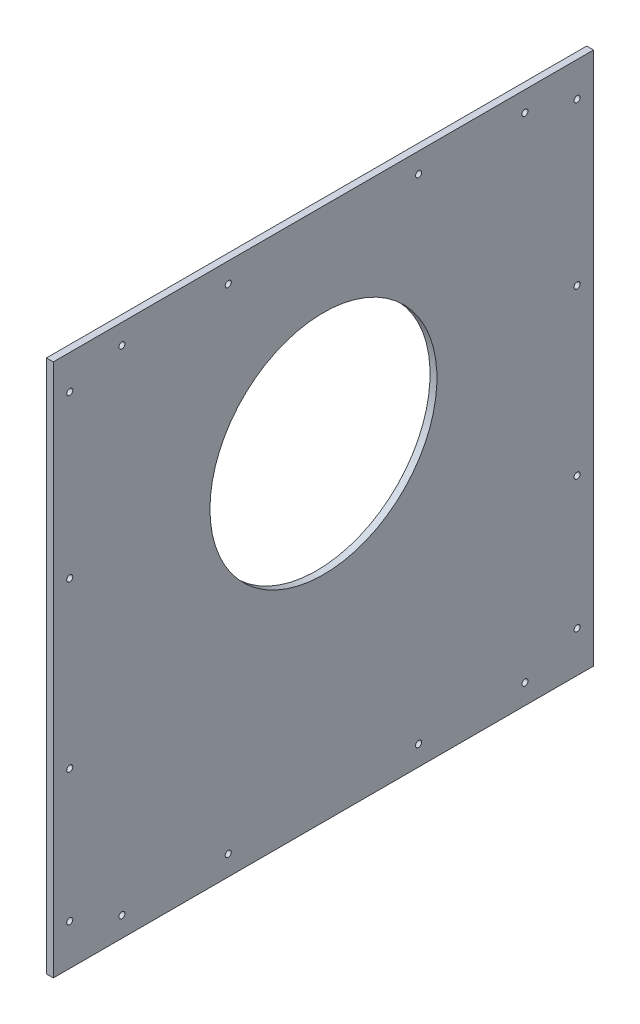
ISO-10303-21;
HEADER;
FILE_DESCRIPTION(('STEP AP214'),'2;1');
FILE_NAME('part.step','',(''),(''),'','','');
FILE_SCHEMA(('AUTOMOTIVE_DESIGN { 1 0 10303 214 1 1 1 1 }'));
ENDSEC;
DATA;
#1=APPLICATION_CONTEXT('core data for automotive mechanical design processes');
#2=APPLICATION_PROTOCOL_DEFINITION('international standard','automotive_design',2000,#1);
#3=PRODUCT_CONTEXT('',#1,'mechanical');
#4=PRODUCT('Part','Part','',(#3));
#5=PRODUCT_RELATED_PRODUCT_CATEGORY('part','',(#4));
#6=PRODUCT_DEFINITION_FORMATION('','',#4);
#7=PRODUCT_DEFINITION_CONTEXT('part definition',#1,'design');
#8=PRODUCT_DEFINITION('design','',#6,#7);
#9=PRODUCT_DEFINITION_SHAPE('','',#8);
#10=(LENGTH_UNIT() NAMED_UNIT(*) SI_UNIT(.MILLI.,.METRE.));
#11=(NAMED_UNIT(*) PLANE_ANGLE_UNIT() SI_UNIT($,.RADIAN.));
#12=(NAMED_UNIT(*) SI_UNIT($,.STERADIAN.) SOLID_ANGLE_UNIT());
#13=UNCERTAINTY_MEASURE_WITH_UNIT(LENGTH_MEASURE(1.E-05),#10,'distance_accuracy_value','');
#14=(GEOMETRIC_REPRESENTATION_CONTEXT(3) GLOBAL_UNCERTAINTY_ASSIGNED_CONTEXT((#13)) GLOBAL_UNIT_ASSIGNED_CONTEXT((#10,
#11,#12)) REPRESENTATION_CONTEXT('',''));
#15=CARTESIAN_POINT('',(0.,0.,0.));
#16=DIRECTION('',(0.,0.,1.));
#17=DIRECTION('',(1.,0.,0.));
#18=AXIS2_PLACEMENT_3D('',#15,#16,#17);
#19=CARTESIAN_POINT('',(6.35,0.,0.));
#20=DIRECTION('',(0.,0.,-1.));
#21=DIRECTION('',(-1.,0.,0.));
#22=AXIS2_PLACEMENT_3D('',#19,#20,#21);
#23=PLANE('',#22);
#24=DIRECTION('',(0.,-1.,0.));
#25=VECTOR('',#24,1.);
#26=CARTESIAN_POINT('',(0.,0.,0.));
#27=LINE('',#26,#25);
#28=CARTESIAN_POINT('',(0.,544.576,0.));
#29=VERTEX_POINT('',#28);
#30=CARTESIAN_POINT('',(0.,50.8,0.));
#31=VERTEX_POINT('',#30);
#32=EDGE_CURVE('E81',#29,#31,#27,.T.);
#33=ORIENTED_EDGE('',*,*,#32,.T.);
#34=DIRECTION('',(-1.,0.,0.));
#35=VECTOR('',#34,1.);
#36=CARTESIAN_POINT('',(6.35,50.8,0.));
#37=LINE('',#36,#35);
#38=CARTESIAN_POINT('',(6.35,50.8,0.));
#39=VERTEX_POINT('',#38);
#40=EDGE_CURVE('E47',#39,#31,#37,.T.);
#41=ORIENTED_EDGE('',*,*,#40,.F.);
#42=DIRECTION('',(0.,-1.,0.));
#43=VECTOR('',#42,1.);
#44=CARTESIAN_POINT('',(6.35,0.,0.));
#45=LINE('',#44,#43);
#46=CARTESIAN_POINT('',(6.35,544.576,0.));
#47=VERTEX_POINT('',#46);
#48=EDGE_CURVE('E76',#47,#39,#45,.T.);
#49=ORIENTED_EDGE('',*,*,#48,.F.);
#50=DIRECTION('',(-1.,0.,0.));
#51=VECTOR('',#50,1.);
#52=CARTESIAN_POINT('',(6.35,544.576,0.));
#53=LINE('',#52,#51);
#54=EDGE_CURVE('E40',#47,#29,#53,.T.);
#55=ORIENTED_EDGE('',*,*,#54,.T.);
#56=EDGE_LOOP('',(#33,#41,#49,#55));
#57=FACE_BOUND('',#56,.T.);
#58=ADVANCED_FACE('F33',(#57),#23,.F.);
#59=CARTESIAN_POINT('',(6.35,0.,-499.999));
#60=DIRECTION('',(0.,0.,1.));
#61=DIRECTION('',(1.,0.,0.));
#62=AXIS2_PLACEMENT_3D('',#59,#60,#61);
#63=PLANE('',#62);
#64=DIRECTION('',(0.,1.,0.));
#65=VECTOR('',#64,1.);
#66=CARTESIAN_POINT('',(6.35,0.,-499.999));
#67=LINE('',#66,#65);
#68=CARTESIAN_POINT('',(6.35,50.8,-499.999));
#69=VERTEX_POINT('',#68);
#70=CARTESIAN_POINT('',(6.35,544.576,-499.999));
#71=VERTEX_POINT('',#70);
#72=EDGE_CURVE('E93',#69,#71,#67,.T.);
#73=ORIENTED_EDGE('',*,*,#72,.F.);
#74=DIRECTION('',(-1.,0.,0.));
#75=VECTOR('',#74,1.);
#76=CARTESIAN_POINT('',(6.35,50.8,-499.999));
#77=LINE('',#76,#75);
#78=CARTESIAN_POINT('',(0.,50.8,-499.999));
#79=VERTEX_POINT('',#78);
#80=EDGE_CURVE('E170',#69,#79,#77,.T.);
#81=ORIENTED_EDGE('',*,*,#80,.T.);
#82=DIRECTION('',(0.,1.,0.));
#83=VECTOR('',#82,1.);
#84=CARTESIAN_POINT('',(0.,0.,-499.999));
#85=LINE('',#84,#83);
#86=CARTESIAN_POINT('',(0.,544.576,-499.999));
#87=VERTEX_POINT('',#86);
#88=EDGE_CURVE('E77',#79,#87,#85,.T.);
#89=ORIENTED_EDGE('',*,*,#88,.T.);
#90=DIRECTION('',(-1.,0.,0.));
#91=VECTOR('',#90,1.);
#92=CARTESIAN_POINT('',(6.35,544.576,-499.999));
#93=LINE('',#92,#91);
#94=EDGE_CURVE('E11',#71,#87,#93,.T.);
#95=ORIENTED_EDGE('',*,*,#94,.F.);
#96=EDGE_LOOP('',(#73,#81,#89,#95));
#97=FACE_BOUND('',#96,.T.);
#98=ADVANCED_FACE('F239',(#97),#63,.F.);
#99=CARTESIAN_POINT('',(6.35,544.576,0.));
#100=DIRECTION('',(0.,-1.,0.));
#101=DIRECTION('',(0.,0.,-1.));
#102=AXIS2_PLACEMENT_3D('',#99,#100,#101);
#103=PLANE('',#102);
#104=DIRECTION('',(0.,0.,1.));
#105=VECTOR('',#104,1.);
#106=CARTESIAN_POINT('',(0.,544.576,0.));
#107=LINE('',#106,#105);
#108=EDGE_CURVE('E68',#87,#29,#107,.T.);
#109=ORIENTED_EDGE('',*,*,#108,.T.);
#110=ORIENTED_EDGE('',*,*,#54,.F.);
#111=DIRECTION('',(0.,0.,1.));
#112=VECTOR('',#111,1.);
#113=CARTESIAN_POINT('',(6.35,544.576,0.));
#114=LINE('',#113,#112);
#115=EDGE_CURVE('E56',#71,#47,#114,.T.);
#116=ORIENTED_EDGE('',*,*,#115,.F.);
#117=ORIENTED_EDGE('',*,*,#94,.T.);
#118=EDGE_LOOP('',(#109,#110,#116,#117));
#119=FACE_BOUND('',#118,.T.);
#120=ADVANCED_FACE('F70',(#119),#103,.F.);
#121=CARTESIAN_POINT('',(6.35,544.576,0.));
#122=DIRECTION('',(-1.,0.,0.));
#123=DIRECTION('',(0.,0.,1.));
#124=AXIS2_PLACEMENT_3D('',#121,#122,#123);
#125=PLANE('',#124);
#126=CARTESIAN_POINT('',(6.35,69.342,-63.5));
#127=DIRECTION('',(-1.,0.,0.));
#128=DIRECTION('',(0.,0.,1.));
#129=AXIS2_PLACEMENT_3D('',#126,#127,#128);
#130=CIRCLE('',#129,2.80669999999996);
#131=CARTESIAN_POINT('',(6.35,69.342,-60.6933000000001));
#132=VERTEX_POINT('',#131);
#133=EDGE_CURVE('E194',#132,#132,#130,.T.);
#134=ORIENTED_EDGE('',*,*,#133,.T.);
#135=EDGE_LOOP('',(#134));
#136=FACE_BOUND('',#135,.T.);
#137=CARTESIAN_POINT('',(6.35,69.342,-161.925));
#138=DIRECTION('',(-1.,0.,0.));
#139=DIRECTION('',(0.,0.,1.));
#140=AXIS2_PLACEMENT_3D('',#137,#138,#139);
#141=CIRCLE('',#140,2.80669999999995);
#142=CARTESIAN_POINT('',(6.35,69.342,-159.1183));
#143=VERTEX_POINT('',#142);
#144=EDGE_CURVE('E188',#143,#143,#141,.T.);
#145=ORIENTED_EDGE('',*,*,#144,.T.);
#146=EDGE_LOOP('',(#145));
#147=FACE_BOUND('',#146,.T.);
#148=CARTESIAN_POINT('',(6.35,69.342,-338.074));
#149=DIRECTION('',(-1.,0.,0.));
#150=DIRECTION('',(0.,0.,1.));
#151=AXIS2_PLACEMENT_3D('',#148,#149,#150);
#152=CIRCLE('',#151,2.80669999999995);
#153=CARTESIAN_POINT('',(6.35,69.342,-335.2673));
#154=VERTEX_POINT('',#153);
#155=EDGE_CURVE('E182',#154,#154,#152,.T.);
#156=ORIENTED_EDGE('',*,*,#155,.T.);
#157=EDGE_LOOP('',(#156));
#158=FACE_BOUND('',#157,.T.);
#159=CARTESIAN_POINT('',(6.35,69.342,-436.499));
#160=DIRECTION('',(-1.,0.,0.));
#161=DIRECTION('',(0.,0.,1.));
#162=AXIS2_PLACEMENT_3D('',#159,#160,#161);
#163=CIRCLE('',#162,2.80669999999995);
#164=CARTESIAN_POINT('',(6.35,69.342,-433.6923));
#165=VERTEX_POINT('',#164);
#166=EDGE_CURVE('E176',#165,#165,#163,.T.);
#167=ORIENTED_EDGE('',*,*,#166,.T.);
#168=EDGE_LOOP('',(#167));
#169=FACE_BOUND('',#168,.T.);
#170=CARTESIAN_POINT('',(6.35,354.076,-249.9995));
#171=DIRECTION('',(-1.,0.,0.));
#172=DIRECTION('',(0.,0.,1.));
#173=AXIS2_PLACEMENT_3D('',#170,#171,#172);
#174=CIRCLE('',#173,105.029);
#175=CARTESIAN_POINT('',(6.35,354.076,-144.9705));
#176=VERTEX_POINT('',#175);
#177=EDGE_CURVE('E162',#176,#176,#174,.T.);
#178=ORIENTED_EDGE('',*,*,#177,.T.);
#179=EDGE_LOOP('',(#178));
#180=FACE_BOUND('',#179,.T.);
#181=CARTESIAN_POINT('',(6.35,88.6777362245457,-15.2399999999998));
#182=DIRECTION('',(1.,0.,0.));
#183=DIRECTION('',(0.,0.,-1.));
#184=AXIS2_PLACEMENT_3D('',#181,#182,#183);
#185=CIRCLE('',#184,2.80670000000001);
#186=CARTESIAN_POINT('',(6.35,88.6777362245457,-18.0466999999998));
#187=VERTEX_POINT('',#186);
#188=EDGE_CURVE('E159',#187,#187,#185,.T.);
#189=ORIENTED_EDGE('',*,*,#188,.F.);
#190=EDGE_LOOP('',(#189));
#191=FACE_BOUND('',#190,.T.);
#192=CARTESIAN_POINT('',(6.35,211.074,-15.2399999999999));
#193=DIRECTION('',(1.,0.,0.));
#194=DIRECTION('',(0.,0.,-1.));
#195=AXIS2_PLACEMENT_3D('',#192,#193,#194);
#196=CIRCLE('',#195,2.80670000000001);
#197=CARTESIAN_POINT('',(6.35,211.074,-18.0466999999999));
#198=VERTEX_POINT('',#197);
#199=EDGE_CURVE('E153',#198,#198,#196,.T.);
#200=ORIENTED_EDGE('',*,*,#199,.F.);
#201=EDGE_LOOP('',(#200));
#202=FACE_BOUND('',#201,.T.);
#203=CARTESIAN_POINT('',(6.35,88.6777362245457,-484.759));
#204=DIRECTION('',(1.,0.,0.));
#205=DIRECTION('',(0.,0.,-1.));
#206=AXIS2_PLACEMENT_3D('',#203,#204,#205);
#207=CIRCLE('',#206,2.80669999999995);
#208=CARTESIAN_POINT('',(6.35,88.6777362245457,-487.5657));
#209=VERTEX_POINT('',#208);
#210=EDGE_CURVE('E147',#209,#209,#207,.T.);
#211=ORIENTED_EDGE('',*,*,#210,.F.);
#212=EDGE_LOOP('',(#211));
#213=FACE_BOUND('',#212,.T.);
#214=CARTESIAN_POINT('',(6.35,211.074,-484.759));
#215=DIRECTION('',(1.,0.,0.));
#216=DIRECTION('',(0.,0.,-1.));
#217=AXIS2_PLACEMENT_3D('',#214,#215,#216);
#218=CIRCLE('',#217,2.80669999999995);
#219=CARTESIAN_POINT('',(6.35,211.074,-487.5657));
#220=VERTEX_POINT('',#219);
#221=EDGE_CURVE('E141',#220,#220,#218,.T.);
#222=ORIENTED_EDGE('',*,*,#221,.F.);
#223=EDGE_LOOP('',(#222));
#224=FACE_BOUND('',#223,.T.);
#225=CARTESIAN_POINT('',(6.35,526.033999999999,-436.499));
#226=DIRECTION('',(1.,0.,0.));
#227=DIRECTION('',(0.,0.,-1.));
#228=AXIS2_PLACEMENT_3D('',#225,#226,#227);
#229=CIRCLE('',#228,2.80669999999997);
#230=CARTESIAN_POINT('',(6.35,526.033999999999,-439.3057));
#231=VERTEX_POINT('',#230);
#232=EDGE_CURVE('E135',#231,#231,#229,.T.);
#233=ORIENTED_EDGE('',*,*,#232,.F.);
#234=EDGE_LOOP('',(#233));
#235=FACE_BOUND('',#234,.T.);
#236=CARTESIAN_POINT('',(6.35,363.474,-484.759));
#237=DIRECTION('',(1.,0.,0.));
#238=DIRECTION('',(0.,0.,-1.));
#239=AXIS2_PLACEMENT_3D('',#236,#237,#238);
#240=CIRCLE('',#239,2.80669999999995);
#241=CARTESIAN_POINT('',(6.35,363.474,-487.5657));
#242=VERTEX_POINT('',#241);
#243=EDGE_CURVE('E129',#242,#242,#240,.T.);
#244=ORIENTED_EDGE('',*,*,#243,.F.);
#245=EDGE_LOOP('',(#244));
#246=FACE_BOUND('',#245,.T.);
#247=CARTESIAN_POINT('',(6.35,526.033999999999,-338.074));
#248=DIRECTION('',(1.,0.,0.));
#249=DIRECTION('',(0.,0.,-1.));
#250=AXIS2_PLACEMENT_3D('',#247,#248,#249);
#251=CIRCLE('',#250,2.80669999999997);
#252=CARTESIAN_POINT('',(6.35,526.033999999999,-340.8807));
#253=VERTEX_POINT('',#252);
#254=EDGE_CURVE('E123',#253,#253,#251,.T.);
#255=ORIENTED_EDGE('',*,*,#254,.F.);
#256=EDGE_LOOP('',(#255));
#257=FACE_BOUND('',#256,.T.);
#258=CARTESIAN_POINT('',(6.35,526.033999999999,-161.925));
#259=DIRECTION('',(1.,0.,0.));
#260=DIRECTION('',(0.,0.,-1.));
#261=AXIS2_PLACEMENT_3D('',#258,#259,#260);
#262=CIRCLE('',#261,2.80669999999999);
#263=CARTESIAN_POINT('',(6.35,526.033999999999,-164.7317));
#264=VERTEX_POINT('',#263);
#265=EDGE_CURVE('E117',#264,#264,#262,.T.);
#266=ORIENTED_EDGE('',*,*,#265,.F.);
#267=EDGE_LOOP('',(#266));
#268=FACE_BOUND('',#267,.T.);
#269=CARTESIAN_POINT('',(6.35,363.474,-15.2399999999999));
#270=DIRECTION('',(1.,0.,0.));
#271=DIRECTION('',(0.,0.,-1.));
#272=AXIS2_PLACEMENT_3D('',#269,#270,#271);
#273=CIRCLE('',#272,2.8067);
#274=CARTESIAN_POINT('',(6.35,363.474,-18.0466999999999));
#275=VERTEX_POINT('',#274);
#276=EDGE_CURVE('E111',#275,#275,#273,.T.);
#277=ORIENTED_EDGE('',*,*,#276,.F.);
#278=EDGE_LOOP('',(#277));
#279=FACE_BOUND('',#278,.T.);
#280=CARTESIAN_POINT('',(6.35,526.033999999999,-63.5));
#281=DIRECTION('',(1.,0.,0.));
#282=DIRECTION('',(0.,0.,-1.));
#283=AXIS2_PLACEMENT_3D('',#280,#281,#282);
#284=CIRCLE('',#283,2.80670000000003);
#285=CARTESIAN_POINT('',(6.35,526.033999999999,-66.3067));
#286=VERTEX_POINT('',#285);
#287=EDGE_CURVE('E105',#286,#286,#284,.T.);
#288=ORIENTED_EDGE('',*,*,#287,.F.);
#289=EDGE_LOOP('',(#288));
#290=FACE_BOUND('',#289,.T.);
#291=CARTESIAN_POINT('',(6.35,512.826,-484.759000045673));
#292=DIRECTION('',(1.,0.,0.));
#293=DIRECTION('',(0.,0.,1.));
#294=AXIS2_PLACEMENT_3D('',#291,#292,#293);
#295=CIRCLE('',#294,2.80670000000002);
#296=CARTESIAN_POINT('',(6.35,512.826,-481.952300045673));
#297=VERTEX_POINT('',#296);
#298=EDGE_CURVE('E99',#297,#297,#295,.T.);
#299=ORIENTED_EDGE('',*,*,#298,.F.);
#300=EDGE_LOOP('',(#299));
#301=FACE_BOUND('',#300,.T.);
#302=CARTESIAN_POINT('',(6.35,512.826,-15.2399999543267));
#303=DIRECTION('',(1.,0.,0.));
#304=DIRECTION('',(0.,0.,-1.));
#305=AXIS2_PLACEMENT_3D('',#302,#303,#304);
#306=CIRCLE('',#305,2.80670000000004);
#307=CARTESIAN_POINT('',(6.35,512.826,-18.0466999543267));
#308=VERTEX_POINT('',#307);
#309=EDGE_CURVE('E89',#308,#308,#306,.T.);
#310=ORIENTED_EDGE('',*,*,#309,.F.);
#311=EDGE_LOOP('',(#310));
#312=FACE_BOUND('',#311,.T.);
#313=ORIENTED_EDGE('',*,*,#48,.T.);
#314=DIRECTION('',(0.,0.,-1.));
#315=VECTOR('',#314,1.);
#316=CARTESIAN_POINT('',(6.35,50.8,-499.999));
#317=LINE('',#316,#315);
#318=EDGE_CURVE('E172',#39,#69,#317,.T.);
#319=ORIENTED_EDGE('',*,*,#318,.T.);
#320=ORIENTED_EDGE('',*,*,#72,.T.);
#321=ORIENTED_EDGE('',*,*,#115,.T.);
#322=EDGE_LOOP('',(#313,#319,#320,#321));
#323=FACE_BOUND('',#322,.T.);
#324=ADVANCED_FACE('F203',(#136,#147,#158,#169,#180,#191,#202,#213,#224,#235,#246,#257,#268,
#279,#290,#301,#312,#323),#125,.F.);
#325=CARTESIAN_POINT('',(0.,544.576,0.));
#326=DIRECTION('',(-1.,0.,0.));
#327=DIRECTION('',(0.,0.,1.));
#328=AXIS2_PLACEMENT_3D('',#325,#326,#327);
#329=PLANE('',#328);
#330=CARTESIAN_POINT('',(0.,69.342,-63.5));
#331=DIRECTION('',(-1.,0.,0.));
#332=DIRECTION('',(0.,0.,1.));
#333=AXIS2_PLACEMENT_3D('',#330,#331,#332);
#334=CIRCLE('',#333,2.80669999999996);
#335=CARTESIAN_POINT('',(0.,69.342,-60.6933000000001));
#336=VERTEX_POINT('',#335);
#337=EDGE_CURVE('E197',#336,#336,#334,.T.);
#338=ORIENTED_EDGE('',*,*,#337,.F.);
#339=EDGE_LOOP('',(#338));
#340=FACE_BOUND('',#339,.T.);
#341=CARTESIAN_POINT('',(0.,69.342,-161.925));
#342=DIRECTION('',(-1.,0.,0.));
#343=DIRECTION('',(0.,0.,1.));
#344=AXIS2_PLACEMENT_3D('',#341,#342,#343);
#345=CIRCLE('',#344,2.80669999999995);
#346=CARTESIAN_POINT('',(0.,69.342,-159.1183));
#347=VERTEX_POINT('',#346);
#348=EDGE_CURVE('E191',#347,#347,#345,.T.);
#349=ORIENTED_EDGE('',*,*,#348,.F.);
#350=EDGE_LOOP('',(#349));
#351=FACE_BOUND('',#350,.T.);
#352=CARTESIAN_POINT('',(0.,69.342,-338.074));
#353=DIRECTION('',(-1.,0.,0.));
#354=DIRECTION('',(0.,0.,1.));
#355=AXIS2_PLACEMENT_3D('',#352,#353,#354);
#356=CIRCLE('',#355,2.80669999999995);
#357=CARTESIAN_POINT('',(0.,69.342,-335.2673));
#358=VERTEX_POINT('',#357);
#359=EDGE_CURVE('E185',#358,#358,#356,.T.);
#360=ORIENTED_EDGE('',*,*,#359,.F.);
#361=EDGE_LOOP('',(#360));
#362=FACE_BOUND('',#361,.T.);
#363=CARTESIAN_POINT('',(0.,69.342,-436.499));
#364=DIRECTION('',(-1.,0.,0.));
#365=DIRECTION('',(0.,0.,1.));
#366=AXIS2_PLACEMENT_3D('',#363,#364,#365);
#367=CIRCLE('',#366,2.80669999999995);
#368=CARTESIAN_POINT('',(0.,69.342,-433.6923));
#369=VERTEX_POINT('',#368);
#370=EDGE_CURVE('E179',#369,#369,#367,.T.);
#371=ORIENTED_EDGE('',*,*,#370,.F.);
#372=EDGE_LOOP('',(#371));
#373=FACE_BOUND('',#372,.T.);
#374=DIRECTION('',(0.,0.,-1.));
#375=VECTOR('',#374,1.);
#376=CARTESIAN_POINT('',(0.,50.8,-499.999));
#377=LINE('',#376,#375);
#378=EDGE_CURVE('E84',#31,#79,#377,.T.);
#379=ORIENTED_EDGE('',*,*,#378,.F.);
#380=ORIENTED_EDGE('',*,*,#32,.F.);
#381=ORIENTED_EDGE('',*,*,#108,.F.);
#382=ORIENTED_EDGE('',*,*,#88,.F.);
#383=EDGE_LOOP('',(#379,#380,#381,#382));
#384=FACE_BOUND('',#383,.T.);
#385=CARTESIAN_POINT('',(0.,354.076,-249.9995));
#386=DIRECTION('',(-1.,0.,0.));
#387=DIRECTION('',(0.,0.,1.));
#388=AXIS2_PLACEMENT_3D('',#385,#386,#387);
#389=CIRCLE('',#388,105.029);
#390=CARTESIAN_POINT('',(0.,354.076,-144.9705));
#391=VERTEX_POINT('',#390);
#392=EDGE_CURVE('E167',#391,#391,#389,.T.);
#393=ORIENTED_EDGE('',*,*,#392,.F.);
#394=EDGE_LOOP('',(#393));
#395=FACE_BOUND('',#394,.T.);
#396=CARTESIAN_POINT('',(0.,88.6777362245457,-15.2399999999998));
#397=DIRECTION('',(1.,0.,0.));
#398=DIRECTION('',(0.,0.,-1.));
#399=AXIS2_PLACEMENT_3D('',#396,#397,#398);
#400=CIRCLE('',#399,2.80670000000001);
#401=CARTESIAN_POINT('',(0.,88.6777362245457,-18.0466999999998));
#402=VERTEX_POINT('',#401);
#403=EDGE_CURVE('E156',#402,#402,#400,.T.);
#404=ORIENTED_EDGE('',*,*,#403,.T.);
#405=EDGE_LOOP('',(#404));
#406=FACE_BOUND('',#405,.T.);
#407=CARTESIAN_POINT('',(0.,211.074,-15.2399999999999));
#408=DIRECTION('',(1.,0.,0.));
#409=DIRECTION('',(0.,0.,-1.));
#410=AXIS2_PLACEMENT_3D('',#407,#408,#409);
#411=CIRCLE('',#410,2.80670000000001);
#412=CARTESIAN_POINT('',(0.,211.074,-18.0466999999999));
#413=VERTEX_POINT('',#412);
#414=EDGE_CURVE('E150',#413,#413,#411,.T.);
#415=ORIENTED_EDGE('',*,*,#414,.T.);
#416=EDGE_LOOP('',(#415));
#417=FACE_BOUND('',#416,.T.);
#418=CARTESIAN_POINT('',(0.,88.6777362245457,-484.759));
#419=DIRECTION('',(1.,0.,0.));
#420=DIRECTION('',(0.,0.,-1.));
#421=AXIS2_PLACEMENT_3D('',#418,#419,#420);
#422=CIRCLE('',#421,2.80669999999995);
#423=CARTESIAN_POINT('',(0.,88.6777362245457,-487.5657));
#424=VERTEX_POINT('',#423);
#425=EDGE_CURVE('E144',#424,#424,#422,.T.);
#426=ORIENTED_EDGE('',*,*,#425,.T.);
#427=EDGE_LOOP('',(#426));
#428=FACE_BOUND('',#427,.T.);
#429=CARTESIAN_POINT('',(0.,211.074,-484.759));
#430=DIRECTION('',(1.,0.,0.));
#431=DIRECTION('',(0.,0.,-1.));
#432=AXIS2_PLACEMENT_3D('',#429,#430,#431);
#433=CIRCLE('',#432,2.80669999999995);
#434=CARTESIAN_POINT('',(0.,211.074,-487.5657));
#435=VERTEX_POINT('',#434);
#436=EDGE_CURVE('E138',#435,#435,#433,.T.);
#437=ORIENTED_EDGE('',*,*,#436,.T.);
#438=EDGE_LOOP('',(#437));
#439=FACE_BOUND('',#438,.T.);
#440=CARTESIAN_POINT('',(0.,526.033999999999,-436.499));
#441=DIRECTION('',(1.,0.,0.));
#442=DIRECTION('',(0.,0.,-1.));
#443=AXIS2_PLACEMENT_3D('',#440,#441,#442);
#444=CIRCLE('',#443,2.80669999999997);
#445=CARTESIAN_POINT('',(0.,526.033999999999,-439.3057));
#446=VERTEX_POINT('',#445);
#447=EDGE_CURVE('E132',#446,#446,#444,.T.);
#448=ORIENTED_EDGE('',*,*,#447,.T.);
#449=EDGE_LOOP('',(#448));
#450=FACE_BOUND('',#449,.T.);
#451=CARTESIAN_POINT('',(0.,363.474,-484.759));
#452=DIRECTION('',(1.,0.,0.));
#453=DIRECTION('',(0.,0.,-1.));
#454=AXIS2_PLACEMENT_3D('',#451,#452,#453);
#455=CIRCLE('',#454,2.80669999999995);
#456=CARTESIAN_POINT('',(0.,363.474,-487.5657));
#457=VERTEX_POINT('',#456);
#458=EDGE_CURVE('E126',#457,#457,#455,.T.);
#459=ORIENTED_EDGE('',*,*,#458,.T.);
#460=EDGE_LOOP('',(#459));
#461=FACE_BOUND('',#460,.T.);
#462=CARTESIAN_POINT('',(0.,526.033999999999,-338.074));
#463=DIRECTION('',(1.,0.,0.));
#464=DIRECTION('',(0.,0.,-1.));
#465=AXIS2_PLACEMENT_3D('',#462,#463,#464);
#466=CIRCLE('',#465,2.80669999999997);
#467=CARTESIAN_POINT('',(0.,526.033999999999,-340.8807));
#468=VERTEX_POINT('',#467);
#469=EDGE_CURVE('E120',#468,#468,#466,.T.);
#470=ORIENTED_EDGE('',*,*,#469,.T.);
#471=EDGE_LOOP('',(#470));
#472=FACE_BOUND('',#471,.T.);
#473=CARTESIAN_POINT('',(0.,526.033999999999,-161.925));
#474=DIRECTION('',(1.,0.,0.));
#475=DIRECTION('',(0.,0.,-1.));
#476=AXIS2_PLACEMENT_3D('',#473,#474,#475);
#477=CIRCLE('',#476,2.80669999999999);
#478=CARTESIAN_POINT('',(0.,526.033999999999,-164.7317));
#479=VERTEX_POINT('',#478);
#480=EDGE_CURVE('E114',#479,#479,#477,.T.);
#481=ORIENTED_EDGE('',*,*,#480,.T.);
#482=EDGE_LOOP('',(#481));
#483=FACE_BOUND('',#482,.T.);
#484=CARTESIAN_POINT('',(0.,363.474,-15.2399999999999));
#485=DIRECTION('',(1.,0.,0.));
#486=DIRECTION('',(0.,0.,-1.));
#487=AXIS2_PLACEMENT_3D('',#484,#485,#486);
#488=CIRCLE('',#487,2.8067);
#489=CARTESIAN_POINT('',(0.,363.474,-18.0466999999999));
#490=VERTEX_POINT('',#489);
#491=EDGE_CURVE('E108',#490,#490,#488,.T.);
#492=ORIENTED_EDGE('',*,*,#491,.T.);
#493=EDGE_LOOP('',(#492));
#494=FACE_BOUND('',#493,.T.);
#495=CARTESIAN_POINT('',(0.,526.033999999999,-63.5));
#496=DIRECTION('',(1.,0.,0.));
#497=DIRECTION('',(0.,0.,-1.));
#498=AXIS2_PLACEMENT_3D('',#495,#496,#497);
#499=CIRCLE('',#498,2.80670000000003);
#500=CARTESIAN_POINT('',(0.,526.033999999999,-66.3067));
#501=VERTEX_POINT('',#500);
#502=EDGE_CURVE('E102',#501,#501,#499,.T.);
#503=ORIENTED_EDGE('',*,*,#502,.T.);
#504=EDGE_LOOP('',(#503));
#505=FACE_BOUND('',#504,.T.);
#506=CARTESIAN_POINT('',(0.,512.826,-484.759000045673));
#507=DIRECTION('',(1.,0.,0.));
#508=DIRECTION('',(0.,0.,1.));
#509=AXIS2_PLACEMENT_3D('',#506,#507,#508);
#510=CIRCLE('',#509,2.80670000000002);
#511=CARTESIAN_POINT('',(0.,512.826,-481.952300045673));
#512=VERTEX_POINT('',#511);
#513=EDGE_CURVE('E97',#512,#512,#510,.T.);
#514=ORIENTED_EDGE('',*,*,#513,.T.);
#515=EDGE_LOOP('',(#514));
#516=FACE_BOUND('',#515,.T.);
#517=CARTESIAN_POINT('',(0.,512.826,-15.2399999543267));
#518=DIRECTION('',(1.,0.,0.));
#519=DIRECTION('',(0.,0.,-1.));
#520=AXIS2_PLACEMENT_3D('',#517,#518,#519);
#521=CIRCLE('',#520,2.80670000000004);
#522=CARTESIAN_POINT('',(0.,512.826,-18.0466999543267));
#523=VERTEX_POINT('',#522);
#524=EDGE_CURVE('E85',#523,#523,#521,.T.);
#525=ORIENTED_EDGE('',*,*,#524,.T.);
#526=EDGE_LOOP('',(#525));
#527=FACE_BOUND('',#526,.T.);
#528=ADVANCED_FACE('F82',(#340,#351,#362,#373,#384,#395,#406,#417,#428,#439,#450,#461,#472,#483,
#494,#505,#516,#527),#329,.T.);
#529=CARTESIAN_POINT('',(0.,512.826,-15.2399999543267));
#530=DIRECTION('',(1.,0.,0.));
#531=DIRECTION('',(0.,0.,-1.));
#532=AXIS2_PLACEMENT_3D('',#529,#530,#531);
#533=CYLINDRICAL_SURFACE('',#532,2.80670000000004);
#534=ORIENTED_EDGE('',*,*,#524,.F.);
#535=EDGE_LOOP('',(#534));
#536=FACE_BOUND('',#535,.T.);
#537=ORIENTED_EDGE('',*,*,#309,.T.);
#538=EDGE_LOOP('',(#537));
#539=FACE_BOUND('',#538,.T.);
#540=ADVANCED_FACE('F215',(#536,#539),#533,.F.);
#541=CARTESIAN_POINT('',(0.,512.826,-484.759000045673));
#542=DIRECTION('',(1.,0.,0.));
#543=DIRECTION('',(0.,0.,-1.));
#544=AXIS2_PLACEMENT_3D('',#541,#542,#543);
#545=CYLINDRICAL_SURFACE('',#544,2.80670000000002);
#546=ORIENTED_EDGE('',*,*,#513,.F.);
#547=EDGE_LOOP('',(#546));
#548=FACE_BOUND('',#547,.T.);
#549=ORIENTED_EDGE('',*,*,#298,.T.);
#550=EDGE_LOOP('',(#549));
#551=FACE_BOUND('',#550,.T.);
#552=ADVANCED_FACE('F254',(#548,#551),#545,.F.);
#553=CARTESIAN_POINT('',(0.,526.033999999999,-63.5));
#554=DIRECTION('',(1.,0.,0.));
#555=DIRECTION('',(0.,0.,-1.));
#556=AXIS2_PLACEMENT_3D('',#553,#554,#555);
#557=CYLINDRICAL_SURFACE('',#556,2.80670000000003);
#558=ORIENTED_EDGE('',*,*,#502,.F.);
#559=EDGE_LOOP('',(#558));
#560=FACE_BOUND('',#559,.T.);
#561=ORIENTED_EDGE('',*,*,#287,.T.);
#562=EDGE_LOOP('',(#561));
#563=FACE_BOUND('',#562,.T.);
#564=ADVANCED_FACE('F258',(#560,#563),#557,.F.);
#565=CARTESIAN_POINT('',(0.,363.474,-15.2399999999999));
#566=DIRECTION('',(1.,0.,0.));
#567=DIRECTION('',(0.,0.,-1.));
#568=AXIS2_PLACEMENT_3D('',#565,#566,#567);
#569=CYLINDRICAL_SURFACE('',#568,2.8067);
#570=ORIENTED_EDGE('',*,*,#491,.F.);
#571=EDGE_LOOP('',(#570));
#572=FACE_BOUND('',#571,.T.);
#573=ORIENTED_EDGE('',*,*,#276,.T.);
#574=EDGE_LOOP('',(#573));
#575=FACE_BOUND('',#574,.T.);
#576=ADVANCED_FACE('F262',(#572,#575),#569,.F.);
#577=CARTESIAN_POINT('',(0.,526.033999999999,-161.925));
#578=DIRECTION('',(1.,0.,0.));
#579=DIRECTION('',(0.,0.,-1.));
#580=AXIS2_PLACEMENT_3D('',#577,#578,#579);
#581=CYLINDRICAL_SURFACE('',#580,2.80669999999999);
#582=ORIENTED_EDGE('',*,*,#480,.F.);
#583=EDGE_LOOP('',(#582));
#584=FACE_BOUND('',#583,.T.);
#585=ORIENTED_EDGE('',*,*,#265,.T.);
#586=EDGE_LOOP('',(#585));
#587=FACE_BOUND('',#586,.T.);
#588=ADVANCED_FACE('F266',(#584,#587),#581,.F.);
#589=CARTESIAN_POINT('',(0.,526.033999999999,-338.074));
#590=DIRECTION('',(1.,0.,0.));
#591=DIRECTION('',(0.,0.,-1.));
#592=AXIS2_PLACEMENT_3D('',#589,#590,#591);
#593=CYLINDRICAL_SURFACE('',#592,2.80669999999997);
#594=ORIENTED_EDGE('',*,*,#469,.F.);
#595=EDGE_LOOP('',(#594));
#596=FACE_BOUND('',#595,.T.);
#597=ORIENTED_EDGE('',*,*,#254,.T.);
#598=EDGE_LOOP('',(#597));
#599=FACE_BOUND('',#598,.T.);
#600=ADVANCED_FACE('F270',(#596,#599),#593,.F.);
#601=CARTESIAN_POINT('',(0.,363.474,-484.759));
#602=DIRECTION('',(1.,0.,0.));
#603=DIRECTION('',(0.,0.,-1.));
#604=AXIS2_PLACEMENT_3D('',#601,#602,#603);
#605=CYLINDRICAL_SURFACE('',#604,2.80669999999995);
#606=ORIENTED_EDGE('',*,*,#458,.F.);
#607=EDGE_LOOP('',(#606));
#608=FACE_BOUND('',#607,.T.);
#609=ORIENTED_EDGE('',*,*,#243,.T.);
#610=EDGE_LOOP('',(#609));
#611=FACE_BOUND('',#610,.T.);
#612=ADVANCED_FACE('F274',(#608,#611),#605,.F.);
#613=CARTESIAN_POINT('',(0.,526.033999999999,-436.499));
#614=DIRECTION('',(1.,0.,0.));
#615=DIRECTION('',(0.,0.,-1.));
#616=AXIS2_PLACEMENT_3D('',#613,#614,#615);
#617=CYLINDRICAL_SURFACE('',#616,2.80669999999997);
#618=ORIENTED_EDGE('',*,*,#447,.F.);
#619=EDGE_LOOP('',(#618));
#620=FACE_BOUND('',#619,.T.);
#621=ORIENTED_EDGE('',*,*,#232,.T.);
#622=EDGE_LOOP('',(#621));
#623=FACE_BOUND('',#622,.T.);
#624=ADVANCED_FACE('F278',(#620,#623),#617,.F.);
#625=CARTESIAN_POINT('',(0.,211.074,-484.759));
#626=DIRECTION('',(1.,0.,0.));
#627=DIRECTION('',(0.,0.,-1.));
#628=AXIS2_PLACEMENT_3D('',#625,#626,#627);
#629=CYLINDRICAL_SURFACE('',#628,2.80669999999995);
#630=ORIENTED_EDGE('',*,*,#436,.F.);
#631=EDGE_LOOP('',(#630));
#632=FACE_BOUND('',#631,.T.);
#633=ORIENTED_EDGE('',*,*,#221,.T.);
#634=EDGE_LOOP('',(#633));
#635=FACE_BOUND('',#634,.T.);
#636=ADVANCED_FACE('F282',(#632,#635),#629,.F.);
#637=CARTESIAN_POINT('',(0.,88.6777362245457,-484.759));
#638=DIRECTION('',(1.,0.,0.));
#639=DIRECTION('',(0.,0.,-1.));
#640=AXIS2_PLACEMENT_3D('',#637,#638,#639);
#641=CYLINDRICAL_SURFACE('',#640,2.80669999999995);
#642=ORIENTED_EDGE('',*,*,#425,.F.);
#643=EDGE_LOOP('',(#642));
#644=FACE_BOUND('',#643,.T.);
#645=ORIENTED_EDGE('',*,*,#210,.T.);
#646=EDGE_LOOP('',(#645));
#647=FACE_BOUND('',#646,.T.);
#648=ADVANCED_FACE('F286',(#644,#647),#641,.F.);
#649=CARTESIAN_POINT('',(0.,211.074,-15.2399999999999));
#650=DIRECTION('',(1.,0.,0.));
#651=DIRECTION('',(0.,0.,-1.));
#652=AXIS2_PLACEMENT_3D('',#649,#650,#651);
#653=CYLINDRICAL_SURFACE('',#652,2.80670000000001);
#654=ORIENTED_EDGE('',*,*,#414,.F.);
#655=EDGE_LOOP('',(#654));
#656=FACE_BOUND('',#655,.T.);
#657=ORIENTED_EDGE('',*,*,#199,.T.);
#658=EDGE_LOOP('',(#657));
#659=FACE_BOUND('',#658,.T.);
#660=ADVANCED_FACE('F290',(#656,#659),#653,.F.);
#661=CARTESIAN_POINT('',(0.,88.6777362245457,-15.2399999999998));
#662=DIRECTION('',(1.,0.,0.));
#663=DIRECTION('',(0.,0.,-1.));
#664=AXIS2_PLACEMENT_3D('',#661,#662,#663);
#665=CYLINDRICAL_SURFACE('',#664,2.80670000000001);
#666=ORIENTED_EDGE('',*,*,#403,.F.);
#667=EDGE_LOOP('',(#666));
#668=FACE_BOUND('',#667,.T.);
#669=ORIENTED_EDGE('',*,*,#188,.T.);
#670=EDGE_LOOP('',(#669));
#671=FACE_BOUND('',#670,.T.);
#672=ADVANCED_FACE('F294',(#668,#671),#665,.F.);
#673=CARTESIAN_POINT('',(12.7,354.076,-249.9995));
#674=DIRECTION('',(-1.,0.,0.));
#675=DIRECTION('',(0.,0.,1.));
#676=AXIS2_PLACEMENT_3D('',#673,#674,#675);
#677=CYLINDRICAL_SURFACE('',#676,105.029);
#678=CARTESIAN_POINT('',(0.,354.076,-144.9705));
#679=CARTESIAN_POINT('',(0.0661458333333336,354.076,-144.9705));
#680=CARTESIAN_POINT('',(0.132291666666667,354.076,-144.9705));
#681=CARTESIAN_POINT('',(0.264583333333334,354.076,-144.9705));
#682=CARTESIAN_POINT('',(0.330729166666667,354.076,-144.9705));
#683=CARTESIAN_POINT('',(0.463020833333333,354.076,-144.9705));
#684=CARTESIAN_POINT('',(0.529166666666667,354.076,-144.9705));
#685=CARTESIAN_POINT('',(0.661458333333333,354.076,-144.9705));
#686=CARTESIAN_POINT('',(0.727604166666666,354.076,-144.9705));
#687=CARTESIAN_POINT('',(0.859895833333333,354.076,-144.9705));
#688=CARTESIAN_POINT('',(0.926041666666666,354.076,-144.9705));
#689=CARTESIAN_POINT('',(1.05833333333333,354.076,-144.9705));
#690=CARTESIAN_POINT('',(1.12447916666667,354.076,-144.9705));
#691=CARTESIAN_POINT('',(1.25677083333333,354.076,-144.9705));
#692=CARTESIAN_POINT('',(1.32291666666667,354.076,-144.9705));
#693=CARTESIAN_POINT('',(1.45520833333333,354.076,-144.9705));
#694=CARTESIAN_POINT('',(1.52135416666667,354.076,-144.9705));
#695=CARTESIAN_POINT('',(1.65364583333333,354.076,-144.9705));
#696=CARTESIAN_POINT('',(1.71979166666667,354.076,-144.9705));
#697=CARTESIAN_POINT('',(1.85208333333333,354.076,-144.9705));
#698=CARTESIAN_POINT('',(1.91822916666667,354.076,-144.9705));
#699=CARTESIAN_POINT('',(2.05052083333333,354.076,-144.9705));
#700=CARTESIAN_POINT('',(2.11666666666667,354.076,-144.9705));
#701=CARTESIAN_POINT('',(2.24895833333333,354.076,-144.9705));
#702=CARTESIAN_POINT('',(2.31510416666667,354.076,-144.9705));
#703=CARTESIAN_POINT('',(2.44739583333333,354.076,-144.9705));
#704=CARTESIAN_POINT('',(2.51354166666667,354.076,-144.9705));
#705=CARTESIAN_POINT('',(2.64583333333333,354.076,-144.9705));
#706=CARTESIAN_POINT('',(2.71197916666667,354.076,-144.9705));
#707=CARTESIAN_POINT('',(2.84427083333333,354.076,-144.9705));
#708=CARTESIAN_POINT('',(2.91041666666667,354.076,-144.9705));
#709=CARTESIAN_POINT('',(3.04270833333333,354.076,-144.9705));
#710=CARTESIAN_POINT('',(3.10885416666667,354.076,-144.9705));
#711=CARTESIAN_POINT('',(3.24114583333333,354.076,-144.9705));
#712=CARTESIAN_POINT('',(3.30729166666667,354.076,-144.9705));
#713=CARTESIAN_POINT('',(3.43958333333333,354.076,-144.9705));
#714=CARTESIAN_POINT('',(3.50572916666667,354.076,-144.9705));
#715=CARTESIAN_POINT('',(3.63802083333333,354.076,-144.9705));
#716=CARTESIAN_POINT('',(3.70416666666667,354.076,-144.9705));
#717=CARTESIAN_POINT('',(3.83645833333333,354.076,-144.9705));
#718=CARTESIAN_POINT('',(3.90260416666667,354.076,-144.9705));
#719=CARTESIAN_POINT('',(4.03489583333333,354.076,-144.9705));
#720=CARTESIAN_POINT('',(4.10104166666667,354.076,-144.9705));
#721=CARTESIAN_POINT('',(4.23333333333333,354.076,-144.9705));
#722=CARTESIAN_POINT('',(4.29947916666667,354.076,-144.9705));
#723=CARTESIAN_POINT('',(4.43177083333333,354.076,-144.9705));
#724=CARTESIAN_POINT('',(4.49791666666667,354.076,-144.9705));
#725=CARTESIAN_POINT('',(4.63020833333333,354.076,-144.9705));
#726=CARTESIAN_POINT('',(4.69635416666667,354.076,-144.9705));
#727=CARTESIAN_POINT('',(4.82864583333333,354.076,-144.9705));
#728=CARTESIAN_POINT('',(4.89479166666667,354.076,-144.9705));
#729=CARTESIAN_POINT('',(5.02708333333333,354.076,-144.9705));
#730=CARTESIAN_POINT('',(5.09322916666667,354.076,-144.9705));
#731=CARTESIAN_POINT('',(5.22552083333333,354.076,-144.9705));
#732=CARTESIAN_POINT('',(5.29166666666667,354.076,-144.9705));
#733=CARTESIAN_POINT('',(5.42395833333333,354.076,-144.9705));
#734=CARTESIAN_POINT('',(5.49010416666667,354.076,-144.9705));
#735=CARTESIAN_POINT('',(5.62239583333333,354.076,-144.9705));
#736=CARTESIAN_POINT('',(5.68854166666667,354.076,-144.9705));
#737=CARTESIAN_POINT('',(5.82083333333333,354.076,-144.9705));
#738=CARTESIAN_POINT('',(5.88697916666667,354.076,-144.9705));
#739=CARTESIAN_POINT('',(6.01927083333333,354.076,-144.9705));
#740=CARTESIAN_POINT('',(6.08541666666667,354.076,-144.9705));
#741=CARTESIAN_POINT('',(6.21770833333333,354.076,-144.9705));
#742=CARTESIAN_POINT('',(6.28385416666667,354.076,-144.9705));
#743=CARTESIAN_POINT('',(6.35,354.076,-144.9705));
#744=B_SPLINE_CURVE_WITH_KNOTS('',3,(#678,#679,#680,#681,#682,#683,#684,#685,#686,#687,#688,
#689,#690,#691,#692,#693,#694,#695,#696,#697,#698,#699,#700,#701,#702,#703,#704,#705,#706,#707,
#708,#709,#710,#711,#712,#713,#714,#715,#716,#717,#718,#719,#720,#721,#722,#723,#724,#725,#726,
#727,#728,#729,#730,#731,#732,#733,#734,#735,#736,#737,#738,#739,#740,#741,#742,#743),
.UNSPECIFIED.,.F.,.F.,(4,2,2,2,2,2,2,2,2,2,2,2,2,2,2,2,2,2,2,2,2,2,2,2,2,2,2,2,2,2,2,2,4),(0.,
0.198437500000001,0.396875,0.5953125,0.793749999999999,0.9921875,1.190625,1.3890625,1.5875,
1.7859375,1.984375,2.1828125,2.38125,2.5796875,2.778125,2.9765625,3.175,3.3734375,3.571875,
3.7703125,3.96875,4.1671875,4.365625,4.5640625,4.7625,4.9609375,5.159375,5.3578125,5.55625,
5.7546875,5.953125,6.1515625,6.35),.UNSPECIFIED.);
#745=EDGE_CURVE('BSEAM235',#391,#176,#744,.T.);
#746=ORIENTED_EDGE('',*,*,#392,.T.);
#747=ORIENTED_EDGE('',*,*,#177,.F.);
#748=ORIENTED_EDGE('',*,*,#745,.T.);
#749=ORIENTED_EDGE('',*,*,#745,.F.);
#750=EDGE_LOOP('',(#746,#748,#747,#749));
#751=FACE_BOUND('',#750,.T.);
#752=ADVANCED_FACE('F235',(#751),#677,.F.);
#753=CARTESIAN_POINT('',(6.35,50.8,-499.999));
#754=DIRECTION('',(0.,1.,0.));
#755=DIRECTION('',(0.,0.,1.));
#756=AXIS2_PLACEMENT_3D('',#753,#754,#755);
#757=PLANE('',#756);
#758=ORIENTED_EDGE('',*,*,#378,.T.);
#759=ORIENTED_EDGE('',*,*,#80,.F.);
#760=ORIENTED_EDGE('',*,*,#318,.F.);
#761=ORIENTED_EDGE('',*,*,#40,.T.);
#762=EDGE_LOOP('',(#758,#759,#760,#761));
#763=FACE_BOUND('',#762,.T.);
#764=ADVANCED_FACE('F226',(#763),#757,.F.);
#765=CARTESIAN_POINT('',(6.35,69.342,-436.499));
#766=DIRECTION('',(-1.,0.,0.));
#767=DIRECTION('',(0.,0.,1.));
#768=AXIS2_PLACEMENT_3D('',#765,#766,#767);
#769=CYLINDRICAL_SURFACE('',#768,2.80669999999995);
#770=ORIENTED_EDGE('',*,*,#166,.F.);
#771=EDGE_LOOP('',(#770));
#772=FACE_BOUND('',#771,.T.);
#773=ORIENTED_EDGE('',*,*,#370,.T.);
#774=EDGE_LOOP('',(#773));
#775=FACE_BOUND('',#774,.T.);
#776=ADVANCED_FACE('F223',(#772,#775),#769,.F.);
#777=CARTESIAN_POINT('',(6.35,69.342,-338.074));
#778=DIRECTION('',(-1.,0.,0.));
#779=DIRECTION('',(0.,0.,1.));
#780=AXIS2_PLACEMENT_3D('',#777,#778,#779);
#781=CYLINDRICAL_SURFACE('',#780,2.80669999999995);
#782=ORIENTED_EDGE('',*,*,#155,.F.);
#783=EDGE_LOOP('',(#782));
#784=FACE_BOUND('',#783,.T.);
#785=ORIENTED_EDGE('',*,*,#359,.T.);
#786=EDGE_LOOP('',(#785));
#787=FACE_BOUND('',#786,.T.);
#788=ADVANCED_FACE('F225',(#784,#787),#781,.F.);
#789=CARTESIAN_POINT('',(6.35,69.342,-161.925));
#790=DIRECTION('',(-1.,0.,0.));
#791=DIRECTION('',(0.,0.,1.));
#792=AXIS2_PLACEMENT_3D('',#789,#790,#791);
#793=CYLINDRICAL_SURFACE('',#792,2.80669999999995);
#794=ORIENTED_EDGE('',*,*,#144,.F.);
#795=EDGE_LOOP('',(#794));
#796=FACE_BOUND('',#795,.T.);
#797=ORIENTED_EDGE('',*,*,#348,.T.);
#798=EDGE_LOOP('',(#797));
#799=FACE_BOUND('',#798,.T.);
#800=ADVANCED_FACE('F209',(#796,#799),#793,.F.);
#801=CARTESIAN_POINT('',(6.35,69.342,-63.5));
#802=DIRECTION('',(-1.,0.,0.));
#803=DIRECTION('',(0.,0.,1.));
#804=AXIS2_PLACEMENT_3D('',#801,#802,#803);
#805=CYLINDRICAL_SURFACE('',#804,2.80669999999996);
#806=ORIENTED_EDGE('',*,*,#133,.F.);
#807=EDGE_LOOP('',(#806));
#808=FACE_BOUND('',#807,.T.);
#809=ORIENTED_EDGE('',*,*,#337,.T.);
#810=EDGE_LOOP('',(#809));
#811=FACE_BOUND('',#810,.T.);
#812=ADVANCED_FACE('F206',(#808,#811),#805,.F.);
#813=CLOSED_SHELL('',(#58,#98,#120,#324,#528,#540,#552,#564,#576,#588,#600,#612,#624,#636,#648,
#660,#672,#752,#764,#776,#788,#800,#812));
#814=MANIFOLD_SOLID_BREP('B2',#813);
#815=ADVANCED_BREP_SHAPE_REPRESENTATION('',(#18,#814),#14);
#816=SHAPE_DEFINITION_REPRESENTATION(#9,#815);
ENDSEC;
END-ISO-10303-21;
